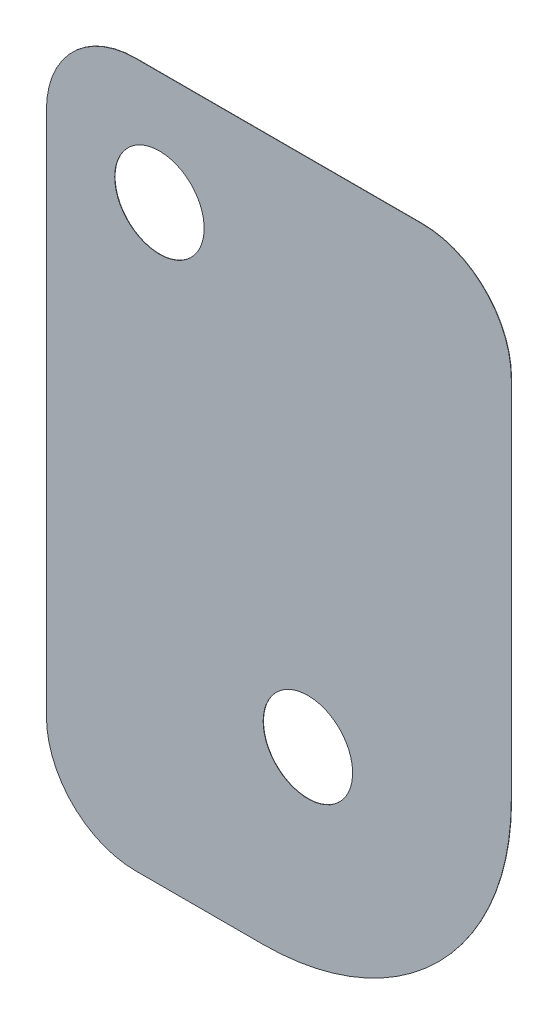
ISO-10303-21;
HEADER;
FILE_DESCRIPTION(('STEP AP214'),'2;1');
FILE_NAME('part.step','',(''),(''),'','','');
FILE_SCHEMA(('AUTOMOTIVE_DESIGN { 1 0 10303 214 1 1 1 1 }'));
ENDSEC;
DATA;
#1=APPLICATION_CONTEXT('core data for automotive mechanical design processes');
#2=APPLICATION_PROTOCOL_DEFINITION('international standard','automotive_design',2000,#1);
#3=PRODUCT_CONTEXT('',#1,'mechanical');
#4=PRODUCT('Part','Part','',(#3));
#5=PRODUCT_RELATED_PRODUCT_CATEGORY('part','',(#4));
#6=PRODUCT_DEFINITION_FORMATION('','',#4);
#7=PRODUCT_DEFINITION_CONTEXT('part definition',#1,'design');
#8=PRODUCT_DEFINITION('design','',#6,#7);
#9=PRODUCT_DEFINITION_SHAPE('','',#8);
#10=(LENGTH_UNIT() NAMED_UNIT(*) SI_UNIT(.MILLI.,.METRE.));
#11=(NAMED_UNIT(*) PLANE_ANGLE_UNIT() SI_UNIT($,.RADIAN.));
#12=(NAMED_UNIT(*) SI_UNIT($,.STERADIAN.) SOLID_ANGLE_UNIT());
#13=UNCERTAINTY_MEASURE_WITH_UNIT(LENGTH_MEASURE(1.E-05),#10,'distance_accuracy_value','');
#14=(GEOMETRIC_REPRESENTATION_CONTEXT(3) GLOBAL_UNCERTAINTY_ASSIGNED_CONTEXT((#13)) GLOBAL_UNIT_ASSIGNED_CONTEXT((#10,
#11,#12)) REPRESENTATION_CONTEXT('',''));
#15=CARTESIAN_POINT('',(0.,0.,0.));
#16=DIRECTION('',(0.,0.,1.));
#17=DIRECTION('',(1.,0.,0.));
#18=AXIS2_PLACEMENT_3D('',#15,#16,#17);
#19=CARTESIAN_POINT('',(-536.321,2.5921597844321,15.8999999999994));
#20=DIRECTION('',(0.,0.,-1.));
#21=DIRECTION('',(-1.,0.,0.));
#22=AXIS2_PLACEMENT_3D('',#19,#20,#21);
#23=CYLINDRICAL_SURFACE('',#22,7.112);
#24=CARTESIAN_POINT('',(-536.321,2.5921597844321,15.8745999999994));
#25=DIRECTION('',(0.,0.,-1.));
#26=DIRECTION('',(-1.,0.,0.));
#27=AXIS2_PLACEMENT_3D('',#24,#25,#26);
#28=CIRCLE('',#27,7.112);
#29=CARTESIAN_POINT('',(-543.433,2.5921597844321,15.8745999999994));
#30=VERTEX_POINT('',#29);
#31=CARTESIAN_POINT('',(-536.321,9.7041597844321,15.8745999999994));
#32=VERTEX_POINT('',#31);
#33=EDGE_CURVE('E172',#30,#32,#28,.T.);
#34=ORIENTED_EDGE('',*,*,#33,.F.);
#35=DIRECTION('',(0.,0.,-1.));
#36=VECTOR('',#35,1.);
#37=CARTESIAN_POINT('',(-543.433,2.5921597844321,15.8999999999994));
#38=LINE('',#37,#36);
#39=CARTESIAN_POINT('',(-543.433,2.5921597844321,15.8999999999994));
#40=VERTEX_POINT('',#39);
#41=EDGE_CURVE('E11',#40,#30,#38,.T.);
#42=ORIENTED_EDGE('',*,*,#41,.F.);
#43=CARTESIAN_POINT('',(-536.321,2.5921597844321,15.8999999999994));
#44=DIRECTION('',(0.,0.,-1.));
#45=DIRECTION('',(-1.,0.,0.));
#46=AXIS2_PLACEMENT_3D('',#43,#44,#45);
#47=CIRCLE('',#46,7.112);
#48=CARTESIAN_POINT('',(-536.321,9.7041597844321,15.8999999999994));
#49=VERTEX_POINT('',#48);
#50=EDGE_CURVE('E200',#40,#49,#47,.T.);
#51=ORIENTED_EDGE('',*,*,#50,.T.);
#52=DIRECTION('',(0.,0.,-1.));
#53=VECTOR('',#52,1.);
#54=CARTESIAN_POINT('',(-536.321,9.7041597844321,15.8999999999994));
#55=LINE('',#54,#53);
#56=EDGE_CURVE('E54',#49,#32,#55,.T.);
#57=ORIENTED_EDGE('',*,*,#56,.T.);
#58=EDGE_LOOP('',(#34,#42,#51,#57));
#59=FACE_BOUND('',#58,.T.);
#60=ADVANCED_FACE('F51',(#59),#23,.T.);
#61=CARTESIAN_POINT('',(-543.433,-39.3178402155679,15.8999999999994));
#62=DIRECTION('',(-1.,0.,0.));
#63=DIRECTION('',(0.,0.,1.));
#64=AXIS2_PLACEMENT_3D('',#61,#62,#63);
#65=PLANE('',#64);
#66=DIRECTION('',(0.,1.,0.));
#67=VECTOR('',#66,1.);
#68=CARTESIAN_POINT('',(-543.433,-39.3178402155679,15.8745999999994));
#69=LINE('',#68,#67);
#70=CARTESIAN_POINT('',(-543.433,-39.3178402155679,15.8745999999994));
#71=VERTEX_POINT('',#70);
#72=EDGE_CURVE('E197',#71,#30,#69,.T.);
#73=ORIENTED_EDGE('',*,*,#72,.F.);
#74=DIRECTION('',(0.,0.,-1.));
#75=VECTOR('',#74,1.);
#76=CARTESIAN_POINT('',(-543.433,-39.3178402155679,15.8999999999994));
#77=LINE('',#76,#75);
#78=CARTESIAN_POINT('',(-543.433,-39.3178402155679,15.8999999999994));
#79=VERTEX_POINT('',#78);
#80=EDGE_CURVE('E61',#79,#71,#77,.T.);
#81=ORIENTED_EDGE('',*,*,#80,.F.);
#82=DIRECTION('',(0.,1.,0.));
#83=VECTOR('',#82,1.);
#84=CARTESIAN_POINT('',(-543.433,-39.3178402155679,15.8999999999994));
#85=LINE('',#84,#83);
#86=EDGE_CURVE('E156',#79,#40,#85,.T.);
#87=ORIENTED_EDGE('',*,*,#86,.T.);
#88=ORIENTED_EDGE('',*,*,#41,.T.);
#89=EDGE_LOOP('',(#73,#81,#87,#88));
#90=FACE_BOUND('',#89,.T.);
#91=ADVANCED_FACE('F217',(#90),#65,.T.);
#92=CARTESIAN_POINT('',(-536.321,-39.3178402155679,15.8999999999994));
#93=DIRECTION('',(0.,0.,-1.));
#94=DIRECTION('',(-1.,0.,0.));
#95=AXIS2_PLACEMENT_3D('',#92,#93,#94);
#96=CYLINDRICAL_SURFACE('',#95,7.11199999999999);
#97=CARTESIAN_POINT('',(-536.321,-39.3178402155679,15.8745999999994));
#98=DIRECTION('',(0.,0.,-1.));
#99=DIRECTION('',(-1.,0.,0.));
#100=AXIS2_PLACEMENT_3D('',#97,#98,#99);
#101=CIRCLE('',#100,7.11199999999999);
#102=CARTESIAN_POINT('',(-536.321,-46.4298402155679,15.8745999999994));
#103=VERTEX_POINT('',#102);
#104=EDGE_CURVE('E142',#103,#71,#101,.T.);
#105=ORIENTED_EDGE('',*,*,#104,.F.);
#106=DIRECTION('',(0.,0.,-1.));
#107=VECTOR('',#106,1.);
#108=CARTESIAN_POINT('',(-536.321,-46.4298402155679,15.8999999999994));
#109=LINE('',#108,#107);
#110=CARTESIAN_POINT('',(-536.321,-46.4298402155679,15.8999999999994));
#111=VERTEX_POINT('',#110);
#112=EDGE_CURVE('E137',#111,#103,#109,.T.);
#113=ORIENTED_EDGE('',*,*,#112,.F.);
#114=CARTESIAN_POINT('',(-536.321,-39.3178402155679,15.8999999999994));
#115=DIRECTION('',(0.,0.,-1.));
#116=DIRECTION('',(-1.,0.,0.));
#117=AXIS2_PLACEMENT_3D('',#114,#115,#116);
#118=CIRCLE('',#117,7.11199999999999);
#119=EDGE_CURVE('E140',#111,#79,#118,.T.);
#120=ORIENTED_EDGE('',*,*,#119,.T.);
#121=ORIENTED_EDGE('',*,*,#80,.T.);
#122=EDGE_LOOP('',(#105,#113,#120,#121));
#123=FACE_BOUND('',#122,.T.);
#124=ADVANCED_FACE('F139',(#123),#96,.T.);
#125=CARTESIAN_POINT('',(-526.161,-46.4298402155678,15.8999999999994));
#126=DIRECTION('',(0.,-1.,0.));
#127=DIRECTION('',(1.,0.,0.));
#128=AXIS2_PLACEMENT_3D('',#125,#126,#127);
#129=PLANE('',#128);
#130=DIRECTION('',(-1.,0.,0.));
#131=VECTOR('',#130,1.);
#132=CARTESIAN_POINT('',(-526.161,-46.4298402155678,15.8745999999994));
#133=LINE('',#132,#131);
#134=CARTESIAN_POINT('',(-526.161,-46.4298402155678,15.8745999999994));
#135=VERTEX_POINT('',#134);
#136=EDGE_CURVE('E192',#135,#103,#133,.T.);
#137=ORIENTED_EDGE('',*,*,#136,.F.);
#138=DIRECTION('',(0.,0.,-1.));
#139=VECTOR('',#138,1.);
#140=CARTESIAN_POINT('',(-526.161,-46.4298402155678,15.8999999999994));
#141=LINE('',#140,#139);
#142=CARTESIAN_POINT('',(-526.161,-46.4298402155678,15.8999999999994));
#143=VERTEX_POINT('',#142);
#144=EDGE_CURVE('E148',#143,#135,#141,.T.);
#145=ORIENTED_EDGE('',*,*,#144,.F.);
#146=DIRECTION('',(-1.,0.,0.));
#147=VECTOR('',#146,1.);
#148=CARTESIAN_POINT('',(-526.161,-46.4298402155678,15.8999999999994));
#149=LINE('',#148,#147);
#150=EDGE_CURVE('E154',#143,#111,#149,.T.);
#151=ORIENTED_EDGE('',*,*,#150,.T.);
#152=ORIENTED_EDGE('',*,*,#112,.T.);
#153=EDGE_LOOP('',(#137,#145,#151,#152));
#154=FACE_BOUND('',#153,.T.);
#155=ADVANCED_FACE('F159',(#154),#129,.T.);
#156=CARTESIAN_POINT('',(-526.161,-26.6178402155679,15.8999999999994));
#157=DIRECTION('',(0.,0.,-1.));
#158=DIRECTION('',(-1.,0.,0.));
#159=AXIS2_PLACEMENT_3D('',#156,#157,#158);
#160=CYLINDRICAL_SURFACE('',#159,19.8119999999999);
#161=CARTESIAN_POINT('',(-526.161,-26.6178402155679,15.8745999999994));
#162=DIRECTION('',(0.,0.,-1.));
#163=DIRECTION('',(-1.,0.,0.));
#164=AXIS2_PLACEMENT_3D('',#161,#162,#163);
#165=CIRCLE('',#164,19.8119999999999);
#166=CARTESIAN_POINT('',(-506.349,-26.6178402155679,15.8745999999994));
#167=VERTEX_POINT('',#166);
#168=EDGE_CURVE('E189',#167,#135,#165,.T.);
#169=ORIENTED_EDGE('',*,*,#168,.F.);
#170=DIRECTION('',(0.,0.,-1.));
#171=VECTOR('',#170,1.);
#172=CARTESIAN_POINT('',(-506.349,-26.6178402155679,15.8999999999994));
#173=LINE('',#172,#171);
#174=CARTESIAN_POINT('',(-506.349,-26.6178402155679,15.8999999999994));
#175=VERTEX_POINT('',#174);
#176=EDGE_CURVE('E205',#175,#167,#173,.T.);
#177=ORIENTED_EDGE('',*,*,#176,.F.);
#178=CARTESIAN_POINT('',(-526.161,-26.6178402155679,15.8999999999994));
#179=DIRECTION('',(0.,0.,-1.));
#180=DIRECTION('',(-1.,0.,0.));
#181=AXIS2_PLACEMENT_3D('',#178,#179,#180);
#182=CIRCLE('',#181,19.8119999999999);
#183=EDGE_CURVE('E161',#175,#143,#182,.T.);
#184=ORIENTED_EDGE('',*,*,#183,.T.);
#185=ORIENTED_EDGE('',*,*,#144,.T.);
#186=EDGE_LOOP('',(#169,#177,#184,#185));
#187=FACE_BOUND('',#186,.T.);
#188=ADVANCED_FACE('F230',(#187),#160,.T.);
#189=CARTESIAN_POINT('',(-506.349,2.5921597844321,15.8999999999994));
#190=DIRECTION('',(1.,0.,0.));
#191=DIRECTION('',(0.,1.,0.));
#192=AXIS2_PLACEMENT_3D('',#189,#190,#191);
#193=PLANE('',#192);
#194=DIRECTION('',(0.,-1.,0.));
#195=VECTOR('',#194,1.);
#196=CARTESIAN_POINT('',(-506.349,2.5921597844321,15.8745999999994));
#197=LINE('',#196,#195);
#198=CARTESIAN_POINT('',(-506.349,2.5921597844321,15.8745999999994));
#199=VERTEX_POINT('',#198);
#200=EDGE_CURVE('E185',#199,#167,#197,.T.);
#201=ORIENTED_EDGE('',*,*,#200,.F.);
#202=DIRECTION('',(0.,0.,-1.));
#203=VECTOR('',#202,1.);
#204=CARTESIAN_POINT('',(-506.349,2.5921597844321,15.8999999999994));
#205=LINE('',#204,#203);
#206=CARTESIAN_POINT('',(-506.349,2.5921597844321,15.8999999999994));
#207=VERTEX_POINT('',#206);
#208=EDGE_CURVE('E208',#207,#199,#205,.T.);
#209=ORIENTED_EDGE('',*,*,#208,.F.);
#210=DIRECTION('',(0.,-1.,0.));
#211=VECTOR('',#210,1.);
#212=CARTESIAN_POINT('',(-506.349,2.5921597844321,15.8999999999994));
#213=LINE('',#212,#211);
#214=EDGE_CURVE('E166',#207,#175,#213,.T.);
#215=ORIENTED_EDGE('',*,*,#214,.T.);
#216=ORIENTED_EDGE('',*,*,#176,.T.);
#217=EDGE_LOOP('',(#201,#209,#215,#216));
#218=FACE_BOUND('',#217,.T.);
#219=ADVANCED_FACE('F233',(#218),#193,.T.);
#220=CARTESIAN_POINT('',(-513.461,2.59215978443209,15.8999999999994));
#221=DIRECTION('',(0.,0.,-1.));
#222=DIRECTION('',(-1.,0.,0.));
#223=AXIS2_PLACEMENT_3D('',#220,#221,#222);
#224=CYLINDRICAL_SURFACE('',#223,7.112);
#225=CARTESIAN_POINT('',(-513.461,2.59215978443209,15.8745999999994));
#226=DIRECTION('',(0.,0.,-1.));
#227=DIRECTION('',(-1.,0.,0.));
#228=AXIS2_PLACEMENT_3D('',#225,#226,#227);
#229=CIRCLE('',#228,7.112);
#230=CARTESIAN_POINT('',(-513.461,9.7041597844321,15.8745999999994));
#231=VERTEX_POINT('',#230);
#232=EDGE_CURVE('E181',#231,#199,#229,.T.);
#233=ORIENTED_EDGE('',*,*,#232,.F.);
#234=DIRECTION('',(0.,0.,-1.));
#235=VECTOR('',#234,1.);
#236=CARTESIAN_POINT('',(-513.461,9.7041597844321,15.8999999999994));
#237=LINE('',#236,#235);
#238=CARTESIAN_POINT('',(-513.461,9.7041597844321,15.8999999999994));
#239=VERTEX_POINT('',#238);
#240=EDGE_CURVE('E210',#239,#231,#237,.T.);
#241=ORIENTED_EDGE('',*,*,#240,.F.);
#242=CARTESIAN_POINT('',(-513.461,2.59215978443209,15.8999999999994));
#243=DIRECTION('',(0.,0.,-1.));
#244=DIRECTION('',(-1.,0.,0.));
#245=AXIS2_PLACEMENT_3D('',#242,#243,#244);
#246=CIRCLE('',#245,7.112);
#247=EDGE_CURVE('E284',#239,#207,#246,.T.);
#248=ORIENTED_EDGE('',*,*,#247,.T.);
#249=ORIENTED_EDGE('',*,*,#208,.T.);
#250=EDGE_LOOP('',(#233,#241,#248,#249));
#251=FACE_BOUND('',#250,.T.);
#252=ADVANCED_FACE('F237',(#251),#224,.T.);
#253=CARTESIAN_POINT('',(-536.321,9.7041597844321,15.8999999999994));
#254=DIRECTION('',(0.,1.,0.));
#255=DIRECTION('',(-1.,0.,0.));
#256=AXIS2_PLACEMENT_3D('',#253,#254,#255);
#257=PLANE('',#256);
#258=DIRECTION('',(1.,0.,0.));
#259=VECTOR('',#258,1.);
#260=CARTESIAN_POINT('',(-536.321,9.7041597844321,15.8745999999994));
#261=LINE('',#260,#259);
#262=EDGE_CURVE('E176',#32,#231,#261,.T.);
#263=ORIENTED_EDGE('',*,*,#262,.F.);
#264=ORIENTED_EDGE('',*,*,#56,.F.);
#265=DIRECTION('',(1.,0.,0.));
#266=VECTOR('',#265,1.);
#267=CARTESIAN_POINT('',(-536.321,9.7041597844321,15.8999999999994));
#268=LINE('',#267,#266);
#269=EDGE_CURVE('E281',#49,#239,#268,.T.);
#270=ORIENTED_EDGE('',*,*,#269,.T.);
#271=ORIENTED_EDGE('',*,*,#240,.T.);
#272=EDGE_LOOP('',(#263,#264,#270,#271));
#273=FACE_BOUND('',#272,.T.);
#274=ADVANCED_FACE('F214',(#273),#257,.T.);
#275=CARTESIAN_POINT('',(-536.321,2.5921597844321,15.8999999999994));
#276=DIRECTION('',(0.,0.,-1.));
#277=DIRECTION('',(-1.,0.,0.));
#278=AXIS2_PLACEMENT_3D('',#275,#276,#277);
#279=PLANE('',#278);
#280=CARTESIAN_POINT('',(-522.572795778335,-31.0085922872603,15.8999999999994));
#281=DIRECTION('',(0.,0.,-1.));
#282=DIRECTION('',(-1.,0.,0.));
#283=AXIS2_PLACEMENT_3D('',#280,#281,#282);
#284=CIRCLE('',#283,3.56869999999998);
#285=CARTESIAN_POINT('',(-526.141495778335,-31.0085922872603,15.8999999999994));
#286=VERTEX_POINT('',#285);
#287=EDGE_CURVE('E263',#286,#286,#284,.T.);
#288=ORIENTED_EDGE('',*,*,#287,.T.);
#289=EDGE_LOOP('',(#288));
#290=FACE_BOUND('',#289,.T.);
#291=CARTESIAN_POINT('',(-534.416,0.687159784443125,15.8999999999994));
#292=DIRECTION('',(0.,0.,-1.));
#293=DIRECTION('',(-1.,0.,0.));
#294=AXIS2_PLACEMENT_3D('',#291,#292,#293);
#295=CIRCLE('',#294,3.56869999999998);
#296=CARTESIAN_POINT('',(-537.9847,0.687159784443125,15.8999999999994));
#297=VERTEX_POINT('',#296);
#298=EDGE_CURVE('E268',#297,#297,#295,.T.);
#299=ORIENTED_EDGE('',*,*,#298,.T.);
#300=EDGE_LOOP('',(#299));
#301=FACE_BOUND('',#300,.T.);
#302=ORIENTED_EDGE('',*,*,#50,.F.);
#303=ORIENTED_EDGE('',*,*,#86,.F.);
#304=ORIENTED_EDGE('',*,*,#119,.F.);
#305=ORIENTED_EDGE('',*,*,#150,.F.);
#306=ORIENTED_EDGE('',*,*,#183,.F.);
#307=ORIENTED_EDGE('',*,*,#214,.F.);
#308=ORIENTED_EDGE('',*,*,#247,.F.);
#309=ORIENTED_EDGE('',*,*,#269,.F.);
#310=EDGE_LOOP('',(#302,#303,#304,#305,#306,#307,#308,#309));
#311=FACE_BOUND('',#310,.T.);
#312=ADVANCED_FACE('F152',(#290,#301,#311),#279,.F.);
#313=CARTESIAN_POINT('',(-536.321,2.5921597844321,15.8745999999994));
#314=DIRECTION('',(0.,0.,-1.));
#315=DIRECTION('',(-1.,0.,0.));
#316=AXIS2_PLACEMENT_3D('',#313,#314,#315);
#317=PLANE('',#316);
#318=CARTESIAN_POINT('',(-522.572795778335,-31.0085922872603,15.8745999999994));
#319=DIRECTION('',(0.,0.,-1.));
#320=DIRECTION('',(-1.,0.,0.));
#321=AXIS2_PLACEMENT_3D('',#318,#319,#320);
#322=CIRCLE('',#321,3.56869999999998);
#323=CARTESIAN_POINT('',(-526.141495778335,-31.0085922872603,15.8745999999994));
#324=VERTEX_POINT('',#323);
#325=EDGE_CURVE('E266',#324,#324,#322,.T.);
#326=ORIENTED_EDGE('',*,*,#325,.F.);
#327=EDGE_LOOP('',(#326));
#328=FACE_BOUND('',#327,.T.);
#329=CARTESIAN_POINT('',(-534.416,0.687159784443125,15.8745999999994));
#330=DIRECTION('',(0.,0.,-1.));
#331=DIRECTION('',(-1.,0.,0.));
#332=AXIS2_PLACEMENT_3D('',#329,#330,#331);
#333=CIRCLE('',#332,3.56869999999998);
#334=CARTESIAN_POINT('',(-537.9847,0.687159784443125,15.8745999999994));
#335=VERTEX_POINT('',#334);
#336=EDGE_CURVE('E177',#335,#335,#333,.T.);
#337=ORIENTED_EDGE('',*,*,#336,.F.);
#338=EDGE_LOOP('',(#337));
#339=FACE_BOUND('',#338,.T.);
#340=ORIENTED_EDGE('',*,*,#33,.T.);
#341=ORIENTED_EDGE('',*,*,#262,.T.);
#342=ORIENTED_EDGE('',*,*,#232,.T.);
#343=ORIENTED_EDGE('',*,*,#200,.T.);
#344=ORIENTED_EDGE('',*,*,#168,.T.);
#345=ORIENTED_EDGE('',*,*,#136,.T.);
#346=ORIENTED_EDGE('',*,*,#104,.T.);
#347=ORIENTED_EDGE('',*,*,#72,.T.);
#348=EDGE_LOOP('',(#340,#341,#342,#343,#344,#345,#346,#347));
#349=FACE_BOUND('',#348,.T.);
#350=ADVANCED_FACE('F216',(#328,#339,#349),#317,.T.);
#351=CARTESIAN_POINT('',(-534.416,0.687159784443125,15.8745999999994));
#352=DIRECTION('',(0.,0.,-1.));
#353=DIRECTION('',(-1.,0.,0.));
#354=AXIS2_PLACEMENT_3D('',#351,#352,#353);
#355=CYLINDRICAL_SURFACE('',#354,3.56869999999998);
#356=ORIENTED_EDGE('',*,*,#298,.F.);
#357=EDGE_LOOP('',(#356));
#358=FACE_BOUND('',#357,.T.);
#359=ORIENTED_EDGE('',*,*,#336,.T.);
#360=EDGE_LOOP('',(#359));
#361=FACE_BOUND('',#360,.T.);
#362=ADVANCED_FACE('F248',(#358,#361),#355,.F.);
#363=CARTESIAN_POINT('',(-522.572795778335,-31.0085922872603,15.8745999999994));
#364=DIRECTION('',(0.,0.,-1.));
#365=DIRECTION('',(-1.,0.,0.));
#366=AXIS2_PLACEMENT_3D('',#363,#364,#365);
#367=CYLINDRICAL_SURFACE('',#366,3.56869999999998);
#368=ORIENTED_EDGE('',*,*,#287,.F.);
#369=EDGE_LOOP('',(#368));
#370=FACE_BOUND('',#369,.T.);
#371=ORIENTED_EDGE('',*,*,#325,.T.);
#372=EDGE_LOOP('',(#371));
#373=FACE_BOUND('',#372,.T.);
#374=ADVANCED_FACE('F255',(#370,#373),#367,.F.);
#375=CLOSED_SHELL('',(#60,#91,#124,#155,#188,#219,#252,#274,#312,#350,#362,#374));
#376=MANIFOLD_SOLID_BREP('B2',#375);
#377=ADVANCED_BREP_SHAPE_REPRESENTATION('',(#18,#376),#14);
#378=SHAPE_DEFINITION_REPRESENTATION(#9,#377);
ENDSEC;
END-ISO-10303-21;
